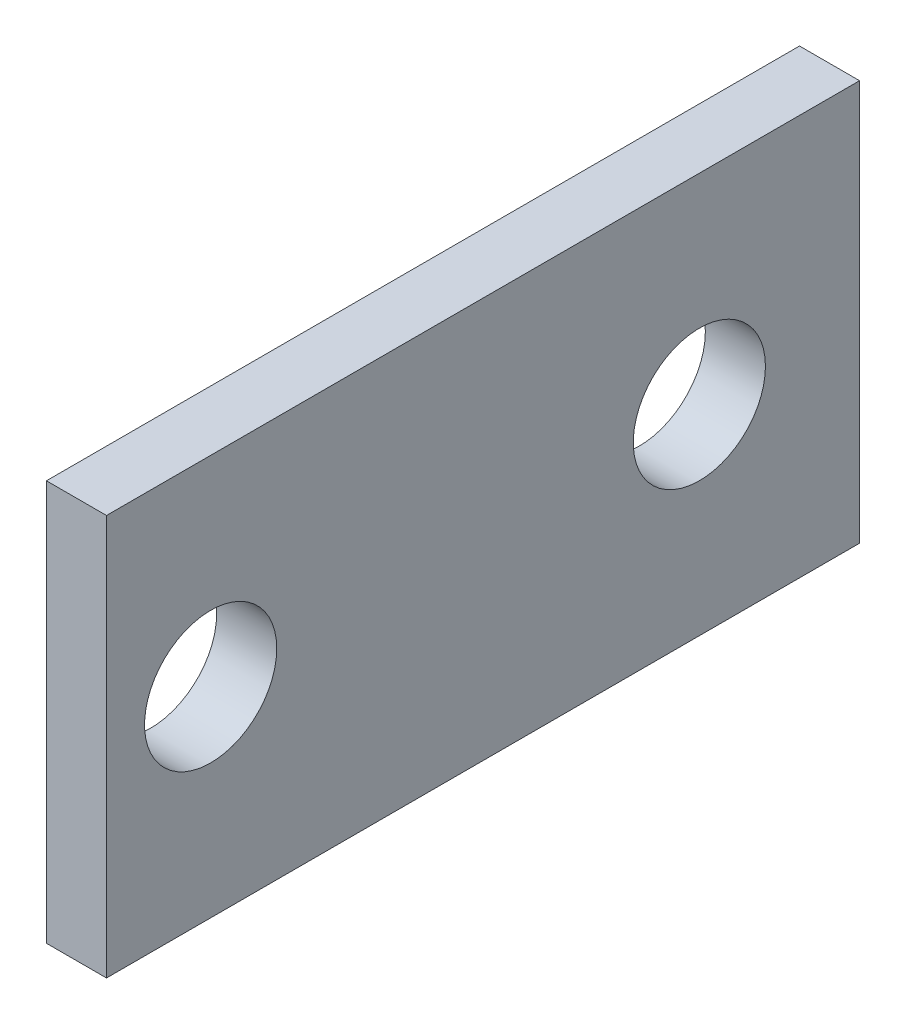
from build123d import *

# Parameters (mm, degrees)
SKICA1_W                = 18.8
SKICA1_H                = 10
SKICA1_R                = 1.65
P_IDAT_VYSUNUT_M1_DEPTH = 1.5


with BuildPart() as part:
    # Skica1 → P_idat vysunut_m1 (new body)
    with BuildSketch(Plane(origin=(0, 0, 0), x_dir=(0, 0, -1), z_dir=(1, 0, 0))):
        with Locations((-8.215496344, -3.493215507)):
            Rectangle(SKICA1_W, SKICA1_H)
        with Locations((-15.015496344, -3.493215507)):
            Circle(SKICA1_R, mode=Mode.SUBTRACT)
        with Locations((-2.815496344, -3.493215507)):
            Circle(SKICA1_R, mode=Mode.SUBTRACT)
    extrude(amount=P_IDAT_VYSUNUT_M1_DEPTH)


solid = part.part
